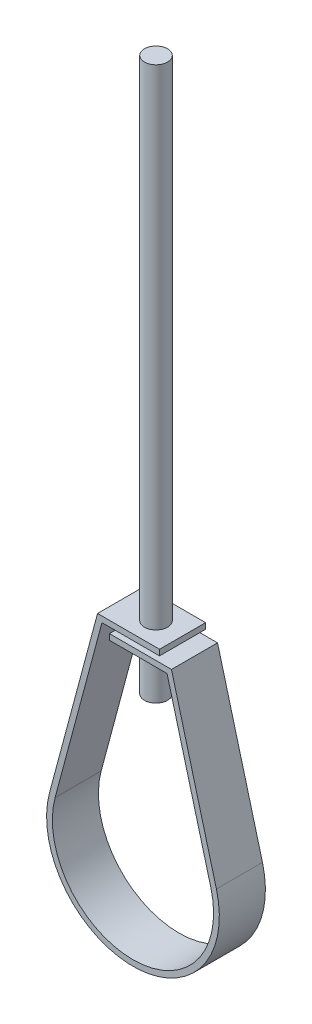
from build123d import *

# Parameters (mm, degrees)
EXTRUDE_THIN1_DEPTH = 12.7
EXTRUDE2_DEPTH      = 279.4
EXTRUDE2_DEPTH_BACK = 25.4
SKETCH2_R           = 6.35


with BuildPart() as part:
    # Sketch1 → Extrude-Thin1 (new, symmetric)
    with BuildSketch(Plane.XY):
        with BuildLine():
            Line((-12.955611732, 101.6), (18.794388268, 101.6))
            Line((18.794388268, 101.6), (42.935402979, 11.504506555))
            ThreePointArc((42.935402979, 11.504506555), (0, -44.45), (-42.935402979, 11.504506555))
            Line((-42.935402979, 11.504506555), (-17.092910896, 107.95))
            Line((-17.092910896, 107.95), (14.657089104, 107.95))
            Line((14.657089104, 107.95), (14.657089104, 111.125))
            Line((14.657089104, 111.125), (-19.529174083, 111.125))
            Line((-19.529174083, 111.125), (-46.002217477, 12.326257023))
            ThreePointArc((-46.002217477, 12.326257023), (0, -47.625), (46.002217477, 12.326257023))
            Line((46.002217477, 12.326257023), (21.230651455, 104.775))
            Line((21.230651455, 104.775), (-12.955611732, 104.775))
            Line((-12.955611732, 104.775), (-12.955611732, 101.6))
        make_face()
    extrude(amount=EXTRUDE_THIN1_DEPTH, both=True)

    # Sketch2 → Extrude2 (add, two sides: drawn at the far end of the back side and taken through both)
    with BuildSketch(Plane(origin=(0, 101.6, 0), x_dir=(1, 0, 0), z_dir=(0, 1, 0)).offset(-EXTRUDE2_DEPTH_BACK)):
        with Locations(Location((0, 0, 0), (0, 0, 270))):
            Circle(SKETCH2_R)
    extrude(amount=EXTRUDE2_DEPTH + EXTRUDE2_DEPTH_BACK)


solid = part.part
